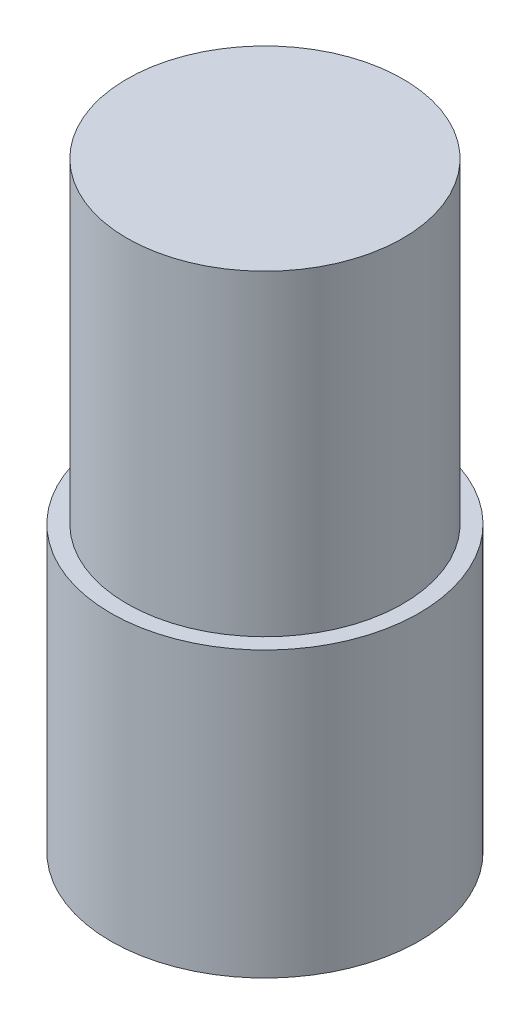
from build123d import *

# Parameters (mm, degrees)
SKETCH_1_R      = 19
EXTRUDE_1_DEPTH = 35
SKETCH_2_R      = 17
EXTRUDE_2_DEPTH = 39
SKETCH_3_R      = 3
EXTRUDE_3_DEPTH = 10


with BuildPart() as part:
    # Sketch 1 → Extrude 1 (new body)
    with BuildSketch(Plane(origin=(0, 0, 0), x_dir=(1, 0, 0), z_dir=(0, 1, 0))):
        with Locations(Location((0, 0, 0), (0, 0, 270))):
            Circle(SKETCH_1_R)
    extrude(amount=EXTRUDE_1_DEPTH)

    # Sketch 2 → Extrude 2 (add)
    with BuildSketch(Plane(origin=(0, 35, 0), x_dir=(1, 0, 0), z_dir=(0, 1, 0))):
        with Locations(Location((0, 0, 0), (0, 0, 270))):
            Circle(SKETCH_2_R)
    extrude(amount=EXTRUDE_2_DEPTH)

    # Sketch 3 → Extrude 3 (add)
    with BuildSketch(Plane.XZ):
        with Locations(Location((0, 0, 0), (0, 0, 270))):
            Circle(SKETCH_3_R)
        with Locations(Location((-12, 0, 0), (0, 0, 90))):
            Circle(SKETCH_3_R)
    extrude(amount=EXTRUDE_3_DEPTH)


solid = part.part
